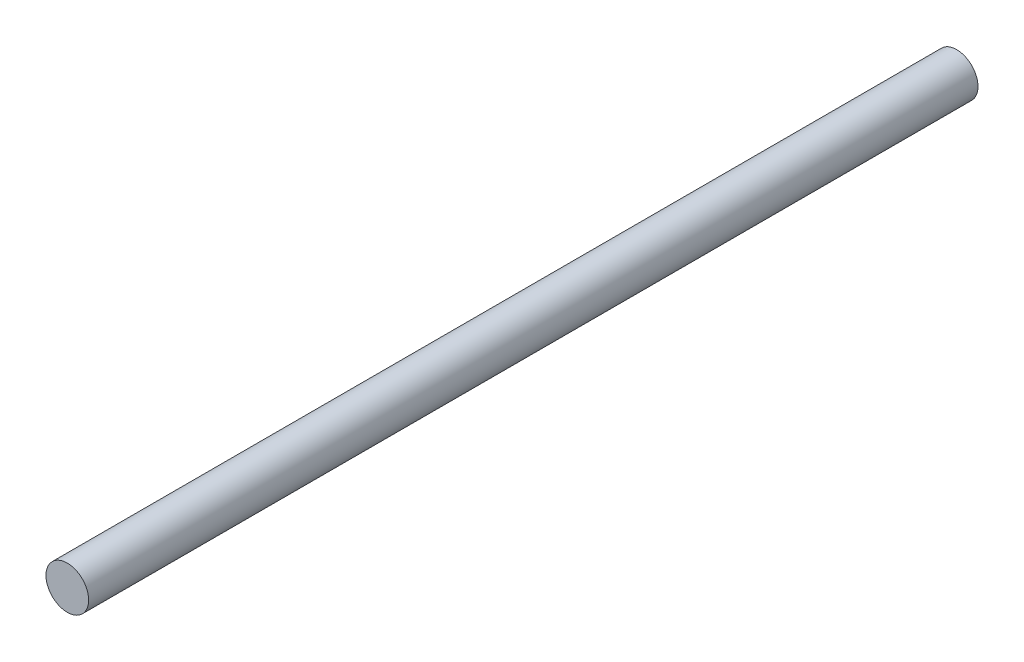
ISO-10303-21;
HEADER;
FILE_DESCRIPTION(('STEP AP214'),'2;1');
FILE_NAME('part.step','',(''),(''),'','','');
FILE_SCHEMA(('AUTOMOTIVE_DESIGN { 1 0 10303 214 1 1 1 1 }'));
ENDSEC;
DATA;
#1=APPLICATION_CONTEXT('core data for automotive mechanical design processes');
#2=APPLICATION_PROTOCOL_DEFINITION('international standard','automotive_design',2000,#1);
#3=PRODUCT_CONTEXT('',#1,'mechanical');
#4=PRODUCT('Part','Part','',(#3));
#5=PRODUCT_RELATED_PRODUCT_CATEGORY('part','',(#4));
#6=PRODUCT_DEFINITION_FORMATION('','',#4);
#7=PRODUCT_DEFINITION_CONTEXT('part definition',#1,'design');
#8=PRODUCT_DEFINITION('design','',#6,#7);
#9=PRODUCT_DEFINITION_SHAPE('','',#8);
#10=(LENGTH_UNIT() NAMED_UNIT(*) SI_UNIT(.MILLI.,.METRE.));
#11=(NAMED_UNIT(*) PLANE_ANGLE_UNIT() SI_UNIT($,.RADIAN.));
#12=(NAMED_UNIT(*) SI_UNIT($,.STERADIAN.) SOLID_ANGLE_UNIT());
#13=UNCERTAINTY_MEASURE_WITH_UNIT(LENGTH_MEASURE(1.E-05),#10,'distance_accuracy_value','');
#14=(GEOMETRIC_REPRESENTATION_CONTEXT(3) GLOBAL_UNCERTAINTY_ASSIGNED_CONTEXT((#13)) GLOBAL_UNIT_ASSIGNED_CONTEXT((#10,
#11,#12)) REPRESENTATION_CONTEXT('',''));
#15=CARTESIAN_POINT('',(0.,0.,0.));
#16=DIRECTION('',(0.,0.,1.));
#17=DIRECTION('',(1.,0.,0.));
#18=AXIS2_PLACEMENT_3D('',#15,#16,#17);
#19=CARTESIAN_POINT('',(0.,0.,-1250.));
#20=DIRECTION('',(0.,0.,1.));
#21=DIRECTION('',(1.,0.,0.));
#22=AXIS2_PLACEMENT_3D('',#19,#20,#21);
#23=CYLINDRICAL_SURFACE('',#22,30.);
#24=CARTESIAN_POINT('',(0.,0.,-1250.));
#25=DIRECTION('',(0.,0.,1.));
#26=DIRECTION('',(1.,0.,0.));
#27=AXIS2_PLACEMENT_3D('',#24,#25,#26);
#28=CIRCLE('',#27,30.);
#29=CARTESIAN_POINT('',(30.,0.,-1250.));
#30=VERTEX_POINT('',#29);
#31=EDGE_CURVE('E10',#30,#30,#28,.T.);
#32=ORIENTED_EDGE('',*,*,#31,.T.);
#33=EDGE_LOOP('',(#32));
#34=FACE_BOUND('',#33,.T.);
#35=CARTESIAN_POINT('',(0.,0.,0.));
#36=DIRECTION('',(0.,0.,1.));
#37=DIRECTION('',(1.,0.,0.));
#38=AXIS2_PLACEMENT_3D('',#35,#36,#37);
#39=CIRCLE('',#38,30.);
#40=CARTESIAN_POINT('',(30.,0.,0.));
#41=VERTEX_POINT('',#40);
#42=EDGE_CURVE('E40',#41,#41,#39,.T.);
#43=ORIENTED_EDGE('',*,*,#42,.F.);
#44=EDGE_LOOP('',(#43));
#45=FACE_BOUND('',#44,.T.);
#46=ADVANCED_FACE('F37',(#34,#45),#23,.T.);
#47=CARTESIAN_POINT('',(0.,0.,-1250.));
#48=DIRECTION('',(0.,0.,1.));
#49=DIRECTION('',(1.,0.,0.));
#50=AXIS2_PLACEMENT_3D('',#47,#48,#49);
#51=PLANE('',#50);
#52=ORIENTED_EDGE('',*,*,#31,.F.);
#53=EDGE_LOOP('',(#52));
#54=FACE_BOUND('',#53,.T.);
#55=ADVANCED_FACE('F54',(#54),#51,.F.);
#56=CARTESIAN_POINT('',(0.,0.,0.));
#57=DIRECTION('',(0.,0.,1.));
#58=DIRECTION('',(1.,0.,0.));
#59=AXIS2_PLACEMENT_3D('',#56,#57,#58);
#60=PLANE('',#59);
#61=ORIENTED_EDGE('',*,*,#42,.T.);
#62=EDGE_LOOP('',(#61));
#63=FACE_BOUND('',#62,.T.);
#64=ADVANCED_FACE('F51',(#63),#60,.T.);
#65=CLOSED_SHELL('',(#46,#55,#64));
#66=MANIFOLD_SOLID_BREP('B2',#65);
#67=ADVANCED_BREP_SHAPE_REPRESENTATION('',(#18,#66),#14);
#68=SHAPE_DEFINITION_REPRESENTATION(#9,#67);
ENDSEC;
END-ISO-10303-21;
